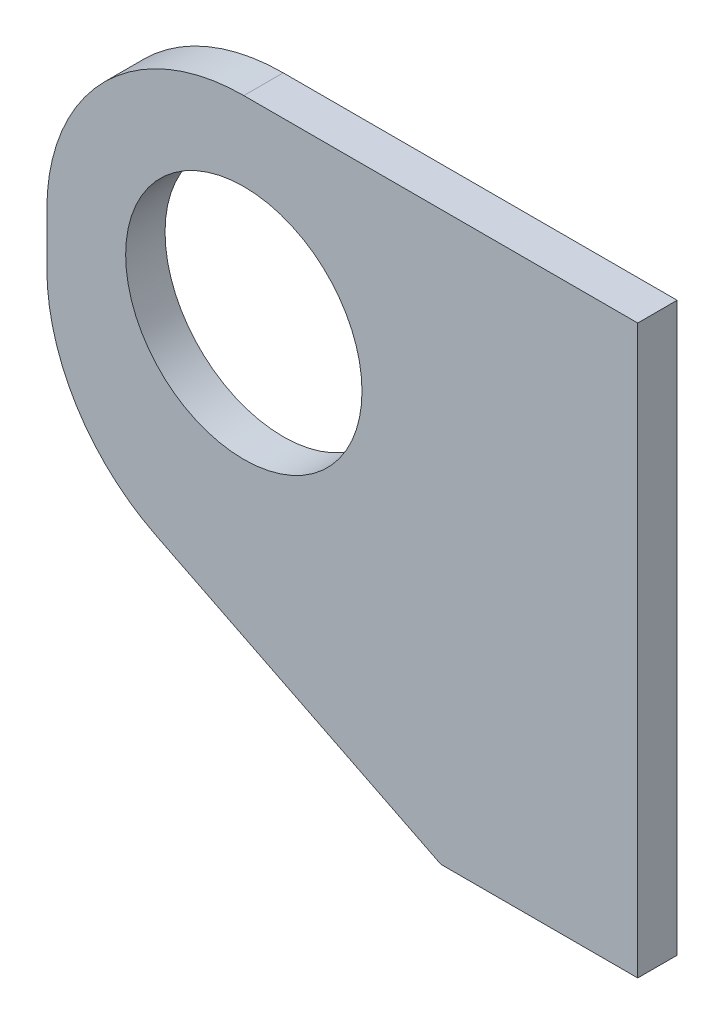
from build123d import *

# Parameters (mm, degrees)
SKETCH1_R           = 30
BOSS_EXTRUDE1_DEPTH = 5
FILLET1_R           = 50


with BuildPart() as part:
    # Sketch1 → Boss-Extrude1 (new, symmetric)
    with BuildSketch(Plane.XY):
        Polygon((0, 0), (0, 144), (-150, 144), (-150, 50), (-50, 0), align=None)
        with Locations((-100, 94)):
            Circle(SKETCH1_R, mode=Mode.SUBTRACT)
    extrude(amount=BOSS_EXTRUDE1_DEPTH, both=True)

    # Fillet1
    fillet1_edges = [part.edges().sort_by_distance(p)[0] for p in [
        (-150, 50, 0),
        (-150, 144, 0),
    ]]
    fillet(fillet1_edges, radius=FILLET1_R)


solid = part.part
